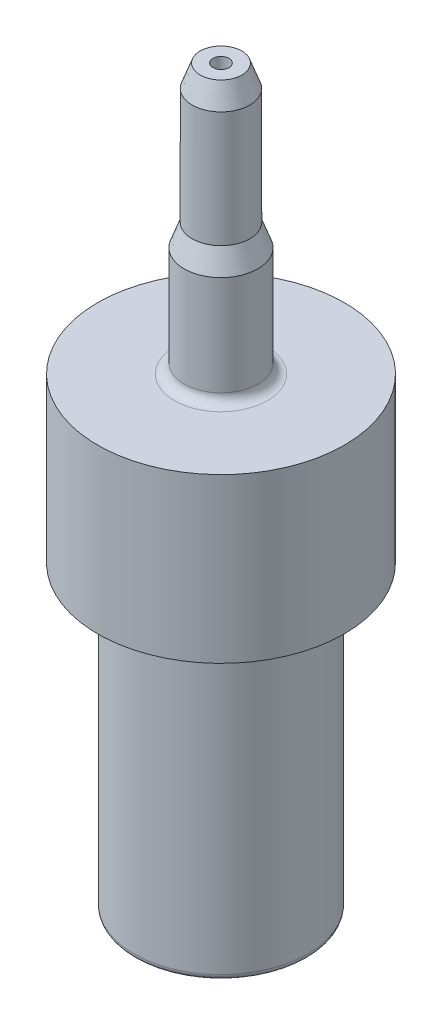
from build123d import *

# Parameters (mm, degrees)
CHAMFER1_SIZE  = 0.25
CHAMFER1_SIZE2 = 0.686869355
FILLET1_R      = 0.3
FILLET2_R      = 0.18


with BuildPart() as part:
    # Sketch1 → Revolve1 (revolve)
    with BuildSketch(Plane.XY):
        Polygon((0.25, 0), (2.7051, 0), (2.7051, 9.4), (3.85, 9.4), (3.85, 14.5), (1.15, 14.5), (1.15, 17.913130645), (0.9, 18.6), (0.9, 22.9), (0.25, 22.9), align=None)
    revolve(axis=Axis((0, -740.300128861, 0), (0, 1, 0)))

    # Chamfer1
    chamfer1_edges = [part.edges().sort_by_distance(p)[0] for p in [
        (-0.9, 22.9, 0),
    ]]
    chamfer1_side = [part.faces().sort_by_distance(p)[0] for p in [
        (-0.874544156, 22.9, 0),
    ]]
    chamfer(chamfer1_edges, length=CHAMFER1_SIZE, length2=CHAMFER1_SIZE2, reference=chamfer1_side[0])

    # Fillet1
    fillet1_edges = [part.edges().sort_by_distance(p)[0] for p in [
        (-2.7051, 9.4, 0),
        (-1.15, 14.5, 0),
    ]]
    fillet(fillet1_edges, radius=FILLET1_R)

    # Fillet2
    fillet2_edges = [part.edges().sort_by_distance(p)[0] for p in [
        (-2.7051, 0, 0),
    ]]
    fillet(fillet2_edges, radius=FILLET2_R)


solid = part.part
